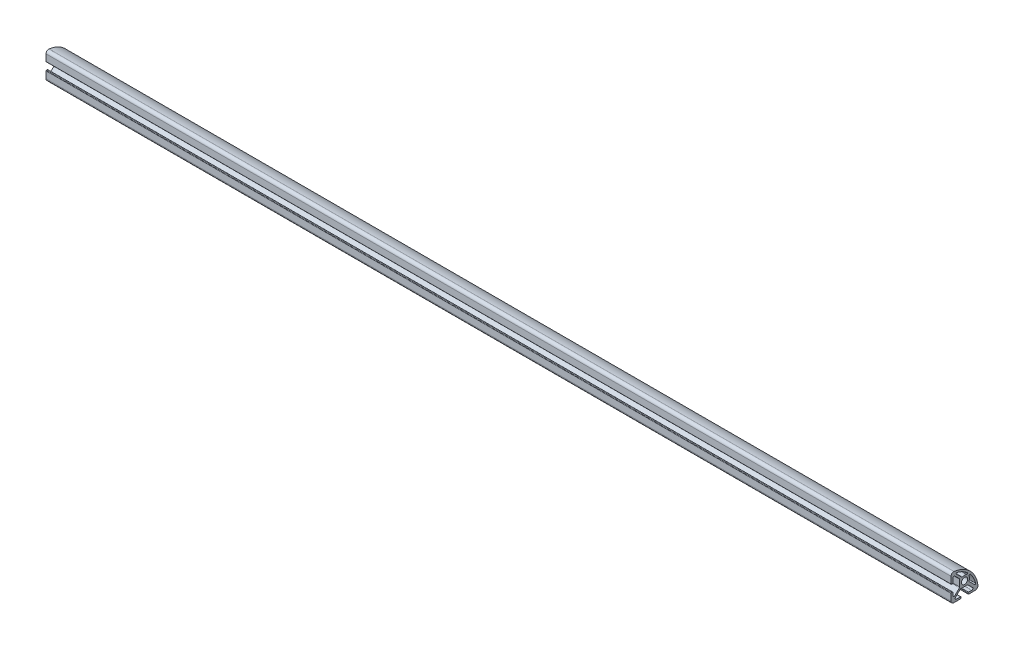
from build123d import *

# Parameters (mm, degrees)
MODEL2_R               = 3.4
STRUKTURBAUTEIL1_DEPTH = 1000


with BuildPart() as part:
    # Model2 → Strukturbauteil1 (new body)
    with BuildSketch(Plane(origin=(0, 0, 0), x_dir=(0, 0, -1), z_dir=(1, 0, 0))):
        with BuildLine():
            Line((-14.5, 4), (-13.5, 4))
            ThreePointArc((-13.5, 4), (-13.146446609, 4.146446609), (-13, 4.5))
            Line((-13, 4.5), (-13, 9.1022583))
            ThreePointArc((-13, 9.1022583), (-12.198882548, 10.301215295), (-10.784616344, 10.019900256))
            Line((-10.784616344, 10.019900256), (-5.692893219, 4.928177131))
            ThreePointArc((-5.692893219, 4.928177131), (-5.476120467, 4.603753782), (-5.4, 4.22107035))
            Line((-5.4, 4.22107035), (-5.4, -3.02107035))
            ThreePointArc((-5.4, -3.02107035), (-5.476120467, -3.403753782), (-5.692893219, -3.728177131))
            Line((-5.692893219, -3.728177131), (-10.784616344, -8.819900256))
            ThreePointArc((-10.784616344, -8.819900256), (-12.198882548, -9.101215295), (-13, -7.9022583))
            Line((-13, -7.9022583), (-13, -4.5))
            ThreePointArc((-13, -4.5), (-13.146446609, -4.146446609), (-13.5, -4))
            Line((-13.5, -4), (-14.5, -4))
            ThreePointArc((-14.5, -4), (-14.853553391, -4.146446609), (-15, -4.5))
            Line((-15, -4.5), (-15, -12))
            ThreePointArc((-15, -12), (-14.121320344, -14.121320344), (-12, -15))
            Line((-12, -15), (-4.5, -15))
            ThreePointArc((-4.5, -15), (-4.146446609, -14.853553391), (-4, -14.5))
            Line((-4, -14.5), (-4, -13.5))
            ThreePointArc((-4, -13.5), (-4.146446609, -13.146446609), (-4.5, -13))
            Line((-4.5, -13), (-9.1022583, -13))
            ThreePointArc((-9.1022583, -13), (-10.301215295, -12.198882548), (-10.019900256, -10.784616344))
            Line((-10.019900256, -10.784616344), (-4.928177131, -5.692893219))
            ThreePointArc((-4.928177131, -5.692893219), (-4.603753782, -5.476120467), (-4.22107035, -5.4))
            Line((-4.22107035, -5.4), (3.02107035, -5.4))
            ThreePointArc((3.02107035, -5.4), (3.403753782, -5.476120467), (3.728177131, -5.692893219))
            Line((3.728177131, -5.692893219), (8.819900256, -10.784616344))
            ThreePointArc((8.819900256, -10.784616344), (9.101215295, -12.198882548), (7.9022583, -13))
            Line((7.9022583, -13), (4.5, -13))
            ThreePointArc((4.5, -13), (4.146446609, -13.146446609), (4, -13.5))
            Line((4, -13.5), (4, -14.5))
            ThreePointArc((4, -14.5), (4.146446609, -14.853553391), (4.5, -15))
            Line((4.5, -15), (11.83281573, -15))
            ThreePointArc((11.83281573, -15), (14.052139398, -14.018564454), (14.819380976, -11.716401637))
            Line((14.819380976, -11.716401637), (14.808642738, -11.616980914))
            ThreePointArc((14.808642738, -11.616980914), (6.213203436, 6.213203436), (-11.616980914, 14.808642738))
            Line((-11.616980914, 14.808642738), (-11.716401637, 14.819380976))
            ThreePointArc((-11.716401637, 14.819380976), (-14.018564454, 14.052139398), (-15, 11.83281573))
            Line((-15, 11.83281573), (-15, 4.5))
            ThreePointArc((-15, 4.5), (-14.853553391, 4.146446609), (-14.5, 4))
        make_face()
        Circle(MODEL2_R, mode=Mode.SUBTRACT)
        with BuildLine():
            Line((5.034824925, -3.070108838), (11.03932101, -9.074604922))
            ThreePointArc((11.03932101, -9.074604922), (11.854854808, -9.201917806), (12.224678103, -8.463991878))
            Line((12.224678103, -8.463991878), (12.20286001, -8.366418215))
            ThreePointArc((12.20286001, -8.366418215), (9.950413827, -2.292645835), (6.362476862, 3.100955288))
            Line((6.362476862, 3.100955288), (6.296388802, 3.175982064))
            ThreePointArc((6.296388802, 3.175982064), (5.800097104, 3.385589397), (5.301891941, 3.180571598))
            Line((5.301891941, 3.180571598), (5.08371871, 2.962398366))
            ThreePointArc((5.08371871, 2.962398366), (4.890571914, 2.59583212), (4.938515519, 2.184276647))
            ThreePointArc((4.938515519, 2.184276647), (5.399746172, -0.052357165), (4.895232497, -2.2796269))
            ThreePointArc((4.895232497, -2.2796269), (4.840465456, -2.696864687), (5.034824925, -3.070108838))
        make_face(mode=Mode.SUBTRACT)
        with BuildLine():
            Line((-3.070108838, 5.034824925), (-9.074604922, 11.03932101))
            ThreePointArc((-9.074604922, 11.03932101), (-9.201917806, 11.854854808), (-8.463991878, 12.224678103))
            Line((-8.463991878, 12.224678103), (-8.366418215, 12.20286001))
            ThreePointArc((-8.366418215, 12.20286001), (-2.292645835, 9.950413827), (3.100955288, 6.362476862))
            Line((3.100955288, 6.362476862), (3.175982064, 6.296388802))
            ThreePointArc((3.175982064, 6.296388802), (3.385589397, 5.800097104), (3.180571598, 5.301891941))
            Line((3.180571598, 5.301891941), (2.962398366, 5.08371871))
            ThreePointArc((2.962398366, 5.08371871), (2.59583212, 4.890571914), (2.184276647, 4.938515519))
            ThreePointArc((2.184276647, 4.938515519), (-0.052357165, 5.399746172), (-2.2796269, 4.895232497))
            ThreePointArc((-2.2796269, 4.895232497), (-2.696864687, 4.840465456), (-3.070108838, 5.034824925))
        make_face(mode=Mode.SUBTRACT)
    extrude(amount=STRUKTURBAUTEIL1_DEPTH)


solid = part.part
